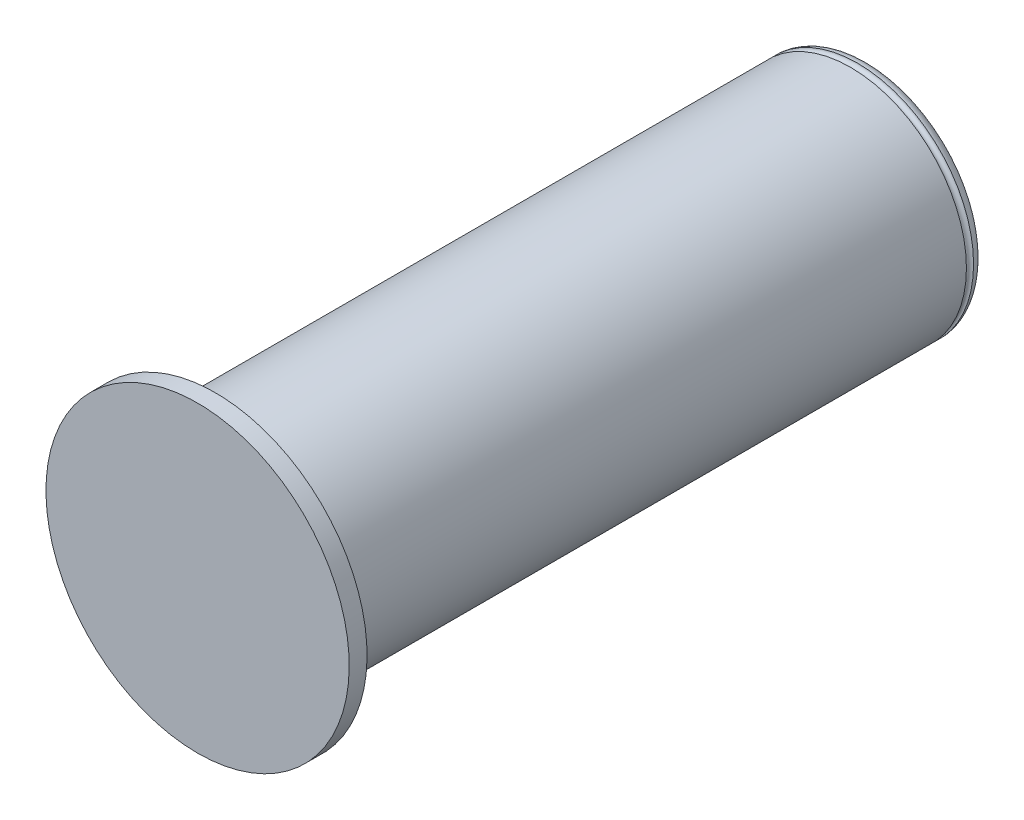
from build123d import *

# Parameters (mm, degrees)
SKETCH2_R = 1


with BuildPart() as part:
    # Sketch1 → Revolve1 (revolve)
    with BuildSketch(Plane(origin=(0, 0, 0), x_dir=(0, 0, -1), z_dir=(1, 0, 0)), mode=Mode.PRIVATE) as revolve1_sk:
        with BuildLine():
            Line((0, 0), (0, 42.5))
            Line((0, 42.5), (5, 42.5))
            Line((5, 42.5), (5, 32.5))
            Line((5, 32.5), (185, 32.5))
            ThreePointArc((185, 32.5), (187.121320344, 31.621320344), (188, 29.5))
            Line((188, 29.5), (188, 4.5))
            Line((188, 4.5), (187.5, 4))
            Line((187.5, 4), (179, 4))
            Line((179, 4), (176.690598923, 0))
            Line((176.690598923, 0), (0, 0))
        make_face()
    revolve(revolve1_sk.sketch.rotate(Axis((0, 0, 0), (0, 0, -1)), 180), axis=Axis((0, 0, 0), (0, 0, -1)))

    # Sketch2 → Cut-Revolve1 (revolve, cut)
    with BuildSketch(Plane(origin=(0, 0, 0), x_dir=(0, 0, -1), z_dir=(1, 0, 0)), mode=Mode.PRIVATE) as cut_revolve1_sk:
        with Locations((184, -32.5)):
            Circle(SKETCH2_R)
    revolve(cut_revolve1_sk.sketch.rotate(Axis((0, 0, -188), (0, 0, 1)), 180), axis=Axis((0, 0, -188), (0, 0, 1)), mode=Mode.SUBTRACT)


solid = part.part
